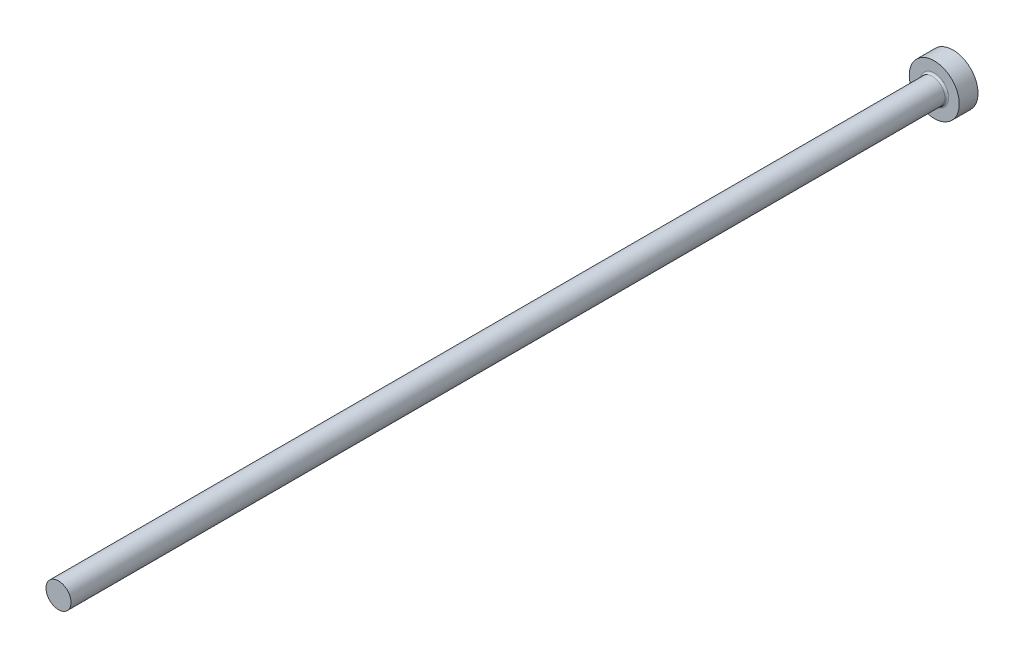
ISO-10303-21;
HEADER;
FILE_DESCRIPTION(('STEP AP214'),'2;1');
FILE_NAME('part.step','',(''),(''),'','','');
FILE_SCHEMA(('AUTOMOTIVE_DESIGN { 1 0 10303 214 1 1 1 1 }'));
ENDSEC;
DATA;
#1=APPLICATION_CONTEXT('core data for automotive mechanical design processes');
#2=APPLICATION_PROTOCOL_DEFINITION('international standard','automotive_design',2000,#1);
#3=PRODUCT_CONTEXT('',#1,'mechanical');
#4=PRODUCT('Part','Part','',(#3));
#5=PRODUCT_RELATED_PRODUCT_CATEGORY('part','',(#4));
#6=PRODUCT_DEFINITION_FORMATION('','',#4);
#7=PRODUCT_DEFINITION_CONTEXT('part definition',#1,'design');
#8=PRODUCT_DEFINITION('design','',#6,#7);
#9=PRODUCT_DEFINITION_SHAPE('','',#8);
#10=(LENGTH_UNIT() NAMED_UNIT(*) SI_UNIT(.MILLI.,.METRE.));
#11=(NAMED_UNIT(*) PLANE_ANGLE_UNIT() SI_UNIT($,.RADIAN.));
#12=(NAMED_UNIT(*) SI_UNIT($,.STERADIAN.) SOLID_ANGLE_UNIT());
#13=UNCERTAINTY_MEASURE_WITH_UNIT(LENGTH_MEASURE(1.E-05),#10,'distance_accuracy_value','');
#14=(GEOMETRIC_REPRESENTATION_CONTEXT(3) GLOBAL_UNCERTAINTY_ASSIGNED_CONTEXT((#13)) GLOBAL_UNIT_ASSIGNED_CONTEXT((#10,
#11,#12)) REPRESENTATION_CONTEXT('',''));
#15=CARTESIAN_POINT('',(0.,0.,0.));
#16=DIRECTION('',(0.,0.,1.));
#17=DIRECTION('',(1.,0.,0.));
#18=AXIS2_PLACEMENT_3D('',#15,#16,#17);
#19=CARTESIAN_POINT('',(-19.8709583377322,-59.4150083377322,-129.9996));
#20=DIRECTION('',(0.,0.,1.));
#21=DIRECTION('',(1.,0.,0.));
#22=AXIS2_PLACEMENT_3D('',#19,#20,#21);
#23=CYLINDRICAL_SURFACE('',#22,2.);
#24=CARTESIAN_POINT('',(-19.8709583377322,-59.4150083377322,-139.7));
#25=DIRECTION('',(0.,0.,-1.));
#26=DIRECTION('',(-1.,0.,0.));
#27=AXIS2_PLACEMENT_3D('',#24,#25,#26);
#28=CIRCLE('',#27,2.);
#29=CARTESIAN_POINT('',(-21.8709583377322,-59.4150083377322,-139.7));
#30=VERTEX_POINT('',#29);
#31=EDGE_CURVE('E10',#30,#30,#28,.F.);
#32=ORIENTED_EDGE('',*,*,#31,.T.);
#33=EDGE_LOOP('',(#32));
#34=FACE_BOUND('',#33,.T.);
#35=CARTESIAN_POINT('',(-19.8709583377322,-59.4150083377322,0.));
#36=DIRECTION('',(0.,0.,1.));
#37=DIRECTION('',(1.,0.,0.));
#38=AXIS2_PLACEMENT_3D('',#35,#36,#37);
#39=CIRCLE('',#38,2.);
#40=CARTESIAN_POINT('',(-17.8709583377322,-59.4150083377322,0.));
#41=VERTEX_POINT('',#40);
#42=EDGE_CURVE('E18',#41,#41,#39,.T.);
#43=ORIENTED_EDGE('',*,*,#42,.F.);
#44=EDGE_LOOP('',(#43));
#45=FACE_BOUND('',#44,.T.);
#46=ADVANCED_FACE('F14',(#34,#45),#23,.T.);
#47=CARTESIAN_POINT('',(-19.8709583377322,-59.4150083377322,-140.));
#48=DIRECTION('',(0.,0.,-1.));
#49=DIRECTION('',(-1.,0.,0.));
#50=AXIS2_PLACEMENT_3D('',#47,#48,#49);
#51=PLANE('',#50);
#52=CARTESIAN_POINT('',(-19.8709583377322,-59.4150083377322,-140.));
#53=DIRECTION('',(0.,0.,-1.));
#54=DIRECTION('',(-1.,0.,0.));
#55=AXIS2_PLACEMENT_3D('',#52,#53,#54);
#56=CIRCLE('',#55,2.3);
#57=CARTESIAN_POINT('',(-22.1709583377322,-59.4150083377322,-140.));
#58=VERTEX_POINT('',#57);
#59=EDGE_CURVE('E22',#58,#58,#56,.T.);
#60=ORIENTED_EDGE('',*,*,#59,.T.);
#61=EDGE_LOOP('',(#60));
#62=FACE_BOUND('',#61,.T.);
#63=CARTESIAN_POINT('',(-19.8709583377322,-59.4150083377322,-140.));
#64=DIRECTION('',(0.,0.,-1.));
#65=DIRECTION('',(-1.,0.,0.));
#66=AXIS2_PLACEMENT_3D('',#63,#64,#65);
#67=CIRCLE('',#66,4.);
#68=CARTESIAN_POINT('',(-23.8709583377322,-59.4150083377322,-140.));
#69=VERTEX_POINT('',#68);
#70=EDGE_CURVE('E26',#69,#69,#67,.T.);
#71=ORIENTED_EDGE('',*,*,#70,.F.);
#72=EDGE_LOOP('',(#71));
#73=FACE_BOUND('',#72,.T.);
#74=ADVANCED_FACE('F38',(#62,#73),#51,.F.);
#75=CARTESIAN_POINT('',(-19.8709583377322,-59.4150083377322,-140.));
#76=DIRECTION('',(0.,0.,-1.));
#77=DIRECTION('',(-1.,0.,0.));
#78=AXIS2_PLACEMENT_3D('',#75,#76,#77);
#79=CYLINDRICAL_SURFACE('',#78,4.);
#80=ORIENTED_EDGE('',*,*,#70,.T.);
#81=EDGE_LOOP('',(#80));
#82=FACE_BOUND('',#81,.T.);
#83=CARTESIAN_POINT('',(-19.8709583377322,-59.4150083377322,-143.));
#84=DIRECTION('',(0.,0.,-1.));
#85=DIRECTION('',(-1.,0.,0.));
#86=AXIS2_PLACEMENT_3D('',#83,#84,#85);
#87=CIRCLE('',#86,4.);
#88=CARTESIAN_POINT('',(-23.8709583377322,-59.4150083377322,-143.));
#89=VERTEX_POINT('',#88);
#90=EDGE_CURVE('E29',#89,#89,#87,.T.);
#91=ORIENTED_EDGE('',*,*,#90,.F.);
#92=EDGE_LOOP('',(#91));
#93=FACE_BOUND('',#92,.T.);
#94=ADVANCED_FACE('F35',(#82,#93),#79,.T.);
#95=CARTESIAN_POINT('',(198.,-100.,-143.));
#96=DIRECTION('',(0.,0.,-1.));
#97=DIRECTION('',(-1.,0.,0.));
#98=AXIS2_PLACEMENT_3D('',#95,#96,#97);
#99=PLANE('',#98);
#100=ORIENTED_EDGE('',*,*,#90,.T.);
#101=EDGE_LOOP('',(#100));
#102=FACE_BOUND('',#101,.T.);
#103=ADVANCED_FACE('F47',(#102),#99,.T.);
#104=CARTESIAN_POINT('',(-19.8709583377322,-59.4150083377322,-139.7));
#105=DIRECTION('',(0.,0.,-1.));
#106=DIRECTION('',(-1.,0.,0.));
#107=AXIS2_PLACEMENT_3D('',#104,#105,#106);
#108=TOROIDAL_SURFACE('',#107,2.3,0.3);
#109=ORIENTED_EDGE('',*,*,#31,.F.);
#110=EDGE_LOOP('',(#109));
#111=FACE_BOUND('',#110,.T.);
#112=ORIENTED_EDGE('',*,*,#59,.F.);
#113=EDGE_LOOP('',(#112));
#114=FACE_BOUND('',#113,.T.);
#115=ADVANCED_FACE('F16',(#111,#114),#108,.F.);
#116=CARTESIAN_POINT('',(-91.8,64.515,0.));
#117=DIRECTION('',(0.,0.,1.));
#118=DIRECTION('',(1.,0.,0.));
#119=AXIS2_PLACEMENT_3D('',#116,#117,#118);
#120=PLANE('',#119);
#121=ORIENTED_EDGE('',*,*,#42,.T.);
#122=EDGE_LOOP('',(#121));
#123=FACE_BOUND('',#122,.T.);
#124=ADVANCED_FACE('F50',(#123),#120,.T.);
#125=CLOSED_SHELL('',(#46,#74,#94,#103,#115,#124));
#126=MANIFOLD_SOLID_BREP('B1',#125);
#127=ADVANCED_BREP_SHAPE_REPRESENTATION('',(#18,#126),#14);
#128=SHAPE_DEFINITION_REPRESENTATION(#9,#127);
ENDSEC;
END-ISO-10303-21;
